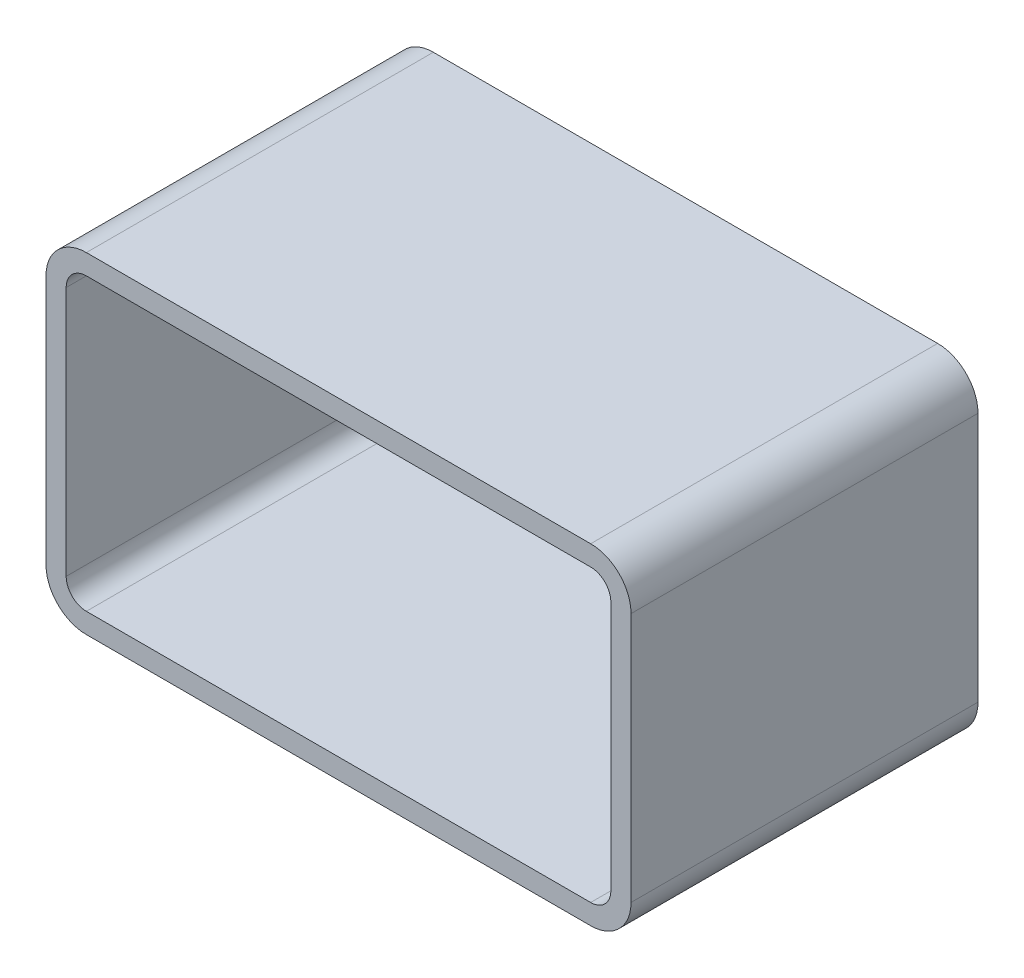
ISO-10303-21;
HEADER;
FILE_DESCRIPTION(('STEP AP214'),'2;1');
FILE_NAME('part.step','',(''),(''),'','','');
FILE_SCHEMA(('AUTOMOTIVE_DESIGN { 1 0 10303 214 1 1 1 1 }'));
ENDSEC;
DATA;
#1=APPLICATION_CONTEXT('core data for automotive mechanical design processes');
#2=APPLICATION_PROTOCOL_DEFINITION('international standard','automotive_design',2000,#1);
#3=PRODUCT_CONTEXT('',#1,'mechanical');
#4=PRODUCT('Part','Part','',(#3));
#5=PRODUCT_RELATED_PRODUCT_CATEGORY('part','',(#4));
#6=PRODUCT_DEFINITION_FORMATION('','',#4);
#7=PRODUCT_DEFINITION_CONTEXT('part definition',#1,'design');
#8=PRODUCT_DEFINITION('design','',#6,#7);
#9=PRODUCT_DEFINITION_SHAPE('','',#8);
#10=(LENGTH_UNIT() NAMED_UNIT(*) SI_UNIT(.MILLI.,.METRE.));
#11=(NAMED_UNIT(*) PLANE_ANGLE_UNIT() SI_UNIT($,.RADIAN.));
#12=(NAMED_UNIT(*) SI_UNIT($,.STERADIAN.) SOLID_ANGLE_UNIT());
#13=UNCERTAINTY_MEASURE_WITH_UNIT(LENGTH_MEASURE(1.E-05),#10,'distance_accuracy_value','');
#14=(GEOMETRIC_REPRESENTATION_CONTEXT(3) GLOBAL_UNCERTAINTY_ASSIGNED_CONTEXT((#13)) GLOBAL_UNIT_ASSIGNED_CONTEXT((#10,
#11,#12)) REPRESENTATION_CONTEXT('',''));
#15=CARTESIAN_POINT('',(0.,0.,0.));
#16=DIRECTION('',(0.,0.,1.));
#17=DIRECTION('',(1.,0.,0.));
#18=AXIS2_PLACEMENT_3D('',#15,#16,#17);
#19=CARTESIAN_POINT('',(0.,164.,0.));
#20=DIRECTION('',(0.,0.,-1.));
#21=DIRECTION('',(-1.,0.,0.));
#22=AXIS2_PLACEMENT_3D('',#19,#20,#21);
#23=PLANE('',#22);
#24=DIRECTION('',(-1.,0.,0.));
#25=VECTOR('',#24,1.);
#26=CARTESIAN_POINT('',(0.,164.,0.));
#27=LINE('',#26,#25);
#28=CARTESIAN_POINT('',(270.,164.,0.));
#29=VERTEX_POINT('',#28);
#30=CARTESIAN_POINT('',(20.,164.,0.));
#31=VERTEX_POINT('',#30);
#32=EDGE_CURVE('E221',#29,#31,#27,.T.);
#33=ORIENTED_EDGE('',*,*,#32,.T.);
#34=CARTESIAN_POINT('',(20.,144.,0.));
#35=DIRECTION('',(0.,0.,-1.));
#36=DIRECTION('',(-1.,0.,0.));
#37=AXIS2_PLACEMENT_3D('',#34,#35,#36);
#38=CIRCLE('',#37,20.);
#39=CARTESIAN_POINT('',(0.,144.,0.));
#40=VERTEX_POINT('',#39);
#41=EDGE_CURVE('E250',#31,#40,#38,.F.);
#42=ORIENTED_EDGE('',*,*,#41,.T.);
#43=DIRECTION('',(0.,-1.,0.));
#44=VECTOR('',#43,1.);
#45=CARTESIAN_POINT('',(0.,0.,0.));
#46=LINE('',#45,#44);
#47=CARTESIAN_POINT('',(0.,20.,0.));
#48=VERTEX_POINT('',#47);
#49=EDGE_CURVE('E200',#40,#48,#46,.T.);
#50=ORIENTED_EDGE('',*,*,#49,.T.);
#51=CARTESIAN_POINT('',(20.,20.,0.));
#52=DIRECTION('',(0.,0.,-1.));
#53=DIRECTION('',(-1.,0.,0.));
#54=AXIS2_PLACEMENT_3D('',#51,#52,#53);
#55=CIRCLE('',#54,20.);
#56=CARTESIAN_POINT('',(20.,0.,0.));
#57=VERTEX_POINT('',#56);
#58=EDGE_CURVE('E248',#48,#57,#55,.F.);
#59=ORIENTED_EDGE('',*,*,#58,.T.);
#60=DIRECTION('',(1.,0.,0.));
#61=VECTOR('',#60,1.);
#62=CARTESIAN_POINT('',(0.,0.,0.));
#63=LINE('',#62,#61);
#64=CARTESIAN_POINT('',(270.,0.,0.));
#65=VERTEX_POINT('',#64);
#66=EDGE_CURVE('E232',#57,#65,#63,.T.);
#67=ORIENTED_EDGE('',*,*,#66,.T.);
#68=CARTESIAN_POINT('',(270.,20.,0.));
#69=DIRECTION('',(0.,0.,-1.));
#70=DIRECTION('',(-1.,0.,0.));
#71=AXIS2_PLACEMENT_3D('',#68,#69,#70);
#72=CIRCLE('',#71,20.);
#73=CARTESIAN_POINT('',(290.,20.,0.));
#74=VERTEX_POINT('',#73);
#75=EDGE_CURVE('E246',#65,#74,#72,.F.);
#76=ORIENTED_EDGE('',*,*,#75,.T.);
#77=DIRECTION('',(0.,1.,0.));
#78=VECTOR('',#77,1.);
#79=CARTESIAN_POINT('',(290.,0.,0.));
#80=LINE('',#79,#78);
#81=CARTESIAN_POINT('',(290.,144.,0.));
#82=VERTEX_POINT('',#81);
#83=EDGE_CURVE('E235',#74,#82,#80,.T.);
#84=ORIENTED_EDGE('',*,*,#83,.T.);
#85=CARTESIAN_POINT('',(270.,144.,0.));
#86=DIRECTION('',(0.,0.,-1.));
#87=DIRECTION('',(-1.,0.,0.));
#88=AXIS2_PLACEMENT_3D('',#85,#86,#87);
#89=CIRCLE('',#88,20.);
#90=EDGE_CURVE('E244',#82,#29,#89,.F.);
#91=ORIENTED_EDGE('',*,*,#90,.T.);
#92=EDGE_LOOP('',(#33,#42,#50,#59,#67,#76,#84,#91));
#93=FACE_BOUND('',#92,.T.);
#94=DIRECTION('',(-1.,0.,0.));
#95=VECTOR('',#94,1.);
#96=CARTESIAN_POINT('',(0.,154.,0.));
#97=LINE('',#96,#95);
#98=CARTESIAN_POINT('',(270.,154.,0.));
#99=VERTEX_POINT('',#98);
#100=CARTESIAN_POINT('',(20.,154.,0.));
#101=VERTEX_POINT('',#100);
#102=EDGE_CURVE('E168',#99,#101,#97,.T.);
#103=ORIENTED_EDGE('',*,*,#102,.F.);
#104=CARTESIAN_POINT('',(270.,144.,0.));
#105=DIRECTION('',(0.,0.,-1.));
#106=DIRECTION('',(-1.,0.,0.));
#107=AXIS2_PLACEMENT_3D('',#104,#105,#106);
#108=CIRCLE('',#107,10.);
#109=CARTESIAN_POINT('',(280.,144.,0.));
#110=VERTEX_POINT('',#109);
#111=EDGE_CURVE('E195',#110,#99,#108,.F.);
#112=ORIENTED_EDGE('',*,*,#111,.F.);
#113=DIRECTION('',(0.,1.,0.));
#114=VECTOR('',#113,1.);
#115=CARTESIAN_POINT('',(280.,0.,0.));
#116=LINE('',#115,#114);
#117=CARTESIAN_POINT('',(280.,20.,0.));
#118=VERTEX_POINT('',#117);
#119=EDGE_CURVE('E47',#118,#110,#116,.T.);
#120=ORIENTED_EDGE('',*,*,#119,.F.);
#121=CARTESIAN_POINT('',(270.,20.,0.));
#122=DIRECTION('',(0.,0.,-1.));
#123=DIRECTION('',(-1.,0.,0.));
#124=AXIS2_PLACEMENT_3D('',#121,#122,#123);
#125=CIRCLE('',#124,10.);
#126=CARTESIAN_POINT('',(270.,10.,0.));
#127=VERTEX_POINT('',#126);
#128=EDGE_CURVE('E208',#127,#118,#125,.F.);
#129=ORIENTED_EDGE('',*,*,#128,.F.);
#130=DIRECTION('',(1.,0.,0.));
#131=VECTOR('',#130,1.);
#132=CARTESIAN_POINT('',(0.,10.,0.));
#133=LINE('',#132,#131);
#134=CARTESIAN_POINT('',(20.,10.,0.));
#135=VERTEX_POINT('',#134);
#136=EDGE_CURVE('E205',#135,#127,#133,.T.);
#137=ORIENTED_EDGE('',*,*,#136,.F.);
#138=CARTESIAN_POINT('',(20.,20.,0.));
#139=DIRECTION('',(0.,0.,-1.));
#140=DIRECTION('',(-1.,0.,0.));
#141=AXIS2_PLACEMENT_3D('',#138,#139,#140);
#142=CIRCLE('',#141,10.);
#143=CARTESIAN_POINT('',(10.,20.,0.));
#144=VERTEX_POINT('',#143);
#145=EDGE_CURVE('E206',#144,#135,#142,.F.);
#146=ORIENTED_EDGE('',*,*,#145,.F.);
#147=DIRECTION('',(0.,-1.,0.));
#148=VECTOR('',#147,1.);
#149=CARTESIAN_POINT('',(10.,0.,0.));
#150=LINE('',#149,#148);
#151=CARTESIAN_POINT('',(10.,144.,0.));
#152=VERTEX_POINT('',#151);
#153=EDGE_CURVE('E203',#152,#144,#150,.T.);
#154=ORIENTED_EDGE('',*,*,#153,.F.);
#155=CARTESIAN_POINT('',(20.,144.,0.));
#156=DIRECTION('',(0.,0.,-1.));
#157=DIRECTION('',(-1.,0.,0.));
#158=AXIS2_PLACEMENT_3D('',#155,#156,#157);
#159=CIRCLE('',#158,10.);
#160=EDGE_CURVE('E154',#101,#152,#159,.F.);
#161=ORIENTED_EDGE('',*,*,#160,.F.);
#162=EDGE_LOOP('',(#103,#112,#120,#129,#137,#146,#154,#161));
#163=FACE_BOUND('',#162,.T.);
#164=ADVANCED_FACE('F32',(#93,#163),#23,.F.);
#165=CARTESIAN_POINT('',(0.,0.,-172.));
#166=DIRECTION('',(-1.,0.,0.));
#167=DIRECTION('',(0.,0.,1.));
#168=AXIS2_PLACEMENT_3D('',#165,#166,#167);
#169=PLANE('',#168);
#170=ORIENTED_EDGE('',*,*,#49,.F.);
#171=DIRECTION('',(0.,0.,1.));
#172=VECTOR('',#171,1.);
#173=CARTESIAN_POINT('',(0.,144.,-172.));
#174=LINE('',#173,#172);
#175=CARTESIAN_POINT('',(0.,144.,-172.));
#176=VERTEX_POINT('',#175);
#177=EDGE_CURVE('E255',#40,#176,#174,.F.);
#178=ORIENTED_EDGE('',*,*,#177,.T.);
#179=DIRECTION('',(0.,-1.,0.));
#180=VECTOR('',#179,1.);
#181=CARTESIAN_POINT('',(0.,0.,-172.));
#182=LINE('',#181,#180);
#183=CARTESIAN_POINT('',(0.,20.,-172.));
#184=VERTEX_POINT('',#183);
#185=EDGE_CURVE('E217',#176,#184,#182,.T.);
#186=ORIENTED_EDGE('',*,*,#185,.T.);
#187=DIRECTION('',(0.,0.,1.));
#188=VECTOR('',#187,1.);
#189=CARTESIAN_POINT('',(0.,20.,-172.));
#190=LINE('',#189,#188);
#191=EDGE_CURVE('E252',#184,#48,#190,.T.);
#192=ORIENTED_EDGE('',*,*,#191,.T.);
#193=EDGE_LOOP('',(#170,#178,#186,#192));
#194=FACE_BOUND('',#193,.T.);
#195=ADVANCED_FACE('F294',(#194),#169,.T.);
#196=CARTESIAN_POINT('',(0.,164.,-172.));
#197=DIRECTION('',(0.,1.,0.));
#198=DIRECTION('',(0.,0.,1.));
#199=AXIS2_PLACEMENT_3D('',#196,#197,#198);
#200=PLANE('',#199);
#201=DIRECTION('',(-1.,0.,0.));
#202=VECTOR('',#201,1.);
#203=CARTESIAN_POINT('',(0.,164.,-172.));
#204=LINE('',#203,#202);
#205=CARTESIAN_POINT('',(270.,164.,-172.));
#206=VERTEX_POINT('',#205);
#207=CARTESIAN_POINT('',(20.,164.,-172.));
#208=VERTEX_POINT('',#207);
#209=EDGE_CURVE('E226',#206,#208,#204,.T.);
#210=ORIENTED_EDGE('',*,*,#209,.T.);
#211=DIRECTION('',(0.,0.,1.));
#212=VECTOR('',#211,1.);
#213=CARTESIAN_POINT('',(20.,164.,-172.));
#214=LINE('',#213,#212);
#215=EDGE_CURVE('E241',#208,#31,#214,.T.);
#216=ORIENTED_EDGE('',*,*,#215,.T.);
#217=ORIENTED_EDGE('',*,*,#32,.F.);
#218=DIRECTION('',(0.,0.,1.));
#219=VECTOR('',#218,1.);
#220=CARTESIAN_POINT('',(270.,164.,-172.));
#221=LINE('',#220,#219);
#222=EDGE_CURVE('E229',#29,#206,#221,.F.);
#223=ORIENTED_EDGE('',*,*,#222,.T.);
#224=EDGE_LOOP('',(#210,#216,#217,#223));
#225=FACE_BOUND('',#224,.T.);
#226=ADVANCED_FACE('F301',(#225),#200,.T.);
#227=CARTESIAN_POINT('',(290.,0.,-172.));
#228=DIRECTION('',(1.,0.,0.));
#229=DIRECTION('',(0.,0.,-1.));
#230=AXIS2_PLACEMENT_3D('',#227,#228,#229);
#231=PLANE('',#230);
#232=ORIENTED_EDGE('',*,*,#83,.F.);
#233=DIRECTION('',(0.,0.,1.));
#234=VECTOR('',#233,1.);
#235=CARTESIAN_POINT('',(290.,20.,-172.));
#236=LINE('',#235,#234);
#237=CARTESIAN_POINT('',(290.,20.,-172.));
#238=VERTEX_POINT('',#237);
#239=EDGE_CURVE('E11',#74,#238,#236,.F.);
#240=ORIENTED_EDGE('',*,*,#239,.T.);
#241=DIRECTION('',(0.,1.,0.));
#242=VECTOR('',#241,1.);
#243=CARTESIAN_POINT('',(290.,0.,-172.));
#244=LINE('',#243,#242);
#245=CARTESIAN_POINT('',(290.,144.,-172.));
#246=VERTEX_POINT('',#245);
#247=EDGE_CURVE('E223',#238,#246,#244,.T.);
#248=ORIENTED_EDGE('',*,*,#247,.T.);
#249=DIRECTION('',(0.,0.,1.));
#250=VECTOR('',#249,1.);
#251=CARTESIAN_POINT('',(290.,144.,-172.));
#252=LINE('',#251,#250);
#253=EDGE_CURVE('E40',#246,#82,#252,.T.);
#254=ORIENTED_EDGE('',*,*,#253,.T.);
#255=EDGE_LOOP('',(#232,#240,#248,#254));
#256=FACE_BOUND('',#255,.T.);
#257=ADVANCED_FACE('F272',(#256),#231,.T.);
#258=CARTESIAN_POINT('',(0.,0.,-172.));
#259=DIRECTION('',(0.,-1.,0.));
#260=DIRECTION('',(0.,0.,-1.));
#261=AXIS2_PLACEMENT_3D('',#258,#259,#260);
#262=PLANE('',#261);
#263=ORIENTED_EDGE('',*,*,#66,.F.);
#264=DIRECTION('',(0.,0.,1.));
#265=VECTOR('',#264,1.);
#266=CARTESIAN_POINT('',(20.,0.,-172.));
#267=LINE('',#266,#265);
#268=CARTESIAN_POINT('',(20.,0.,-172.));
#269=VERTEX_POINT('',#268);
#270=EDGE_CURVE('E267',#57,#269,#267,.F.);
#271=ORIENTED_EDGE('',*,*,#270,.T.);
#272=DIRECTION('',(1.,0.,0.));
#273=VECTOR('',#272,1.);
#274=CARTESIAN_POINT('',(0.,0.,-172.));
#275=LINE('',#274,#273);
#276=CARTESIAN_POINT('',(270.,0.,-172.));
#277=VERTEX_POINT('',#276);
#278=EDGE_CURVE('E220',#269,#277,#275,.T.);
#279=ORIENTED_EDGE('',*,*,#278,.T.);
#280=DIRECTION('',(0.,0.,1.));
#281=VECTOR('',#280,1.);
#282=CARTESIAN_POINT('',(270.,0.,-172.));
#283=LINE('',#282,#281);
#284=EDGE_CURVE('E264',#277,#65,#283,.T.);
#285=ORIENTED_EDGE('',*,*,#284,.T.);
#286=EDGE_LOOP('',(#263,#271,#279,#285));
#287=FACE_BOUND('',#286,.T.);
#288=ADVANCED_FACE('F284',(#287),#262,.T.);
#289=CARTESIAN_POINT('',(0.,164.,-172.));
#290=DIRECTION('',(0.,0.,-1.));
#291=DIRECTION('',(-1.,0.,0.));
#292=AXIS2_PLACEMENT_3D('',#289,#290,#291);
#293=PLANE('',#292);
#294=ORIENTED_EDGE('',*,*,#185,.F.);
#295=CARTESIAN_POINT('',(20.,144.,-172.));
#296=DIRECTION('',(0.,0.,-1.));
#297=DIRECTION('',(-1.,0.,0.));
#298=AXIS2_PLACEMENT_3D('',#295,#296,#297);
#299=CIRCLE('',#298,20.);
#300=EDGE_CURVE('E262',#176,#208,#299,.T.);
#301=ORIENTED_EDGE('',*,*,#300,.T.);
#302=ORIENTED_EDGE('',*,*,#209,.F.);
#303=CARTESIAN_POINT('',(270.,144.,-172.));
#304=DIRECTION('',(0.,0.,-1.));
#305=DIRECTION('',(-1.,0.,0.));
#306=AXIS2_PLACEMENT_3D('',#303,#304,#305);
#307=CIRCLE('',#306,20.);
#308=EDGE_CURVE('E257',#206,#246,#307,.T.);
#309=ORIENTED_EDGE('',*,*,#308,.T.);
#310=ORIENTED_EDGE('',*,*,#247,.F.);
#311=CARTESIAN_POINT('',(270.,20.,-172.));
#312=DIRECTION('',(0.,0.,-1.));
#313=DIRECTION('',(-1.,0.,0.));
#314=AXIS2_PLACEMENT_3D('',#311,#312,#313);
#315=CIRCLE('',#314,20.);
#316=EDGE_CURVE('E55',#238,#277,#315,.T.);
#317=ORIENTED_EDGE('',*,*,#316,.T.);
#318=ORIENTED_EDGE('',*,*,#278,.F.);
#319=CARTESIAN_POINT('',(20.,20.,-172.));
#320=DIRECTION('',(0.,0.,-1.));
#321=DIRECTION('',(-1.,0.,0.));
#322=AXIS2_PLACEMENT_3D('',#319,#320,#321);
#323=CIRCLE('',#322,20.);
#324=EDGE_CURVE('E260',#269,#184,#323,.T.);
#325=ORIENTED_EDGE('',*,*,#324,.T.);
#326=EDGE_LOOP('',(#294,#301,#302,#309,#310,#317,#318,#325));
#327=FACE_BOUND('',#326,.T.);
#328=ADVANCED_FACE('F288',(#327),#293,.T.);
#329=CARTESIAN_POINT('',(20.,144.,-172.));
#330=DIRECTION('',(0.,0.,1.));
#331=DIRECTION('',(1.,0.,0.));
#332=AXIS2_PLACEMENT_3D('',#329,#330,#331);
#333=CYLINDRICAL_SURFACE('',#332,20.);
#334=ORIENTED_EDGE('',*,*,#300,.F.);
#335=ORIENTED_EDGE('',*,*,#177,.F.);
#336=ORIENTED_EDGE('',*,*,#41,.F.);
#337=ORIENTED_EDGE('',*,*,#215,.F.);
#338=EDGE_LOOP('',(#334,#335,#336,#337));
#339=FACE_BOUND('',#338,.T.);
#340=ADVANCED_FACE('F299',(#339),#333,.T.);
#341=CARTESIAN_POINT('',(20.,20.,-172.));
#342=DIRECTION('',(0.,0.,1.));
#343=DIRECTION('',(1.,0.,0.));
#344=AXIS2_PLACEMENT_3D('',#341,#342,#343);
#345=CYLINDRICAL_SURFACE('',#344,20.);
#346=ORIENTED_EDGE('',*,*,#324,.F.);
#347=ORIENTED_EDGE('',*,*,#270,.F.);
#348=ORIENTED_EDGE('',*,*,#58,.F.);
#349=ORIENTED_EDGE('',*,*,#191,.F.);
#350=EDGE_LOOP('',(#346,#347,#348,#349));
#351=FACE_BOUND('',#350,.T.);
#352=ADVANCED_FACE('F291',(#351),#345,.T.);
#353=CARTESIAN_POINT('',(270.,20.,-172.));
#354=DIRECTION('',(0.,0.,1.));
#355=DIRECTION('',(1.,0.,0.));
#356=AXIS2_PLACEMENT_3D('',#353,#354,#355);
#357=CYLINDRICAL_SURFACE('',#356,20.);
#358=ORIENTED_EDGE('',*,*,#316,.F.);
#359=ORIENTED_EDGE('',*,*,#239,.F.);
#360=ORIENTED_EDGE('',*,*,#75,.F.);
#361=ORIENTED_EDGE('',*,*,#284,.F.);
#362=EDGE_LOOP('',(#358,#359,#360,#361));
#363=FACE_BOUND('',#362,.T.);
#364=ADVANCED_FACE('F282',(#363),#357,.T.);
#365=CARTESIAN_POINT('',(270.,144.,-172.));
#366=DIRECTION('',(0.,0.,1.));
#367=DIRECTION('',(1.,0.,0.));
#368=AXIS2_PLACEMENT_3D('',#365,#366,#367);
#369=CYLINDRICAL_SURFACE('',#368,20.);
#370=ORIENTED_EDGE('',*,*,#308,.F.);
#371=ORIENTED_EDGE('',*,*,#222,.F.);
#372=ORIENTED_EDGE('',*,*,#90,.F.);
#373=ORIENTED_EDGE('',*,*,#253,.F.);
#374=EDGE_LOOP('',(#370,#371,#372,#373));
#375=FACE_BOUND('',#374,.T.);
#376=ADVANCED_FACE('F34',(#375),#369,.T.);
#377=CARTESIAN_POINT('',(10.,0.,-172.));
#378=DIRECTION('',(-1.,0.,0.));
#379=DIRECTION('',(0.,0.,1.));
#380=AXIS2_PLACEMENT_3D('',#377,#378,#379);
#381=PLANE('',#380);
#382=ORIENTED_EDGE('',*,*,#153,.T.);
#383=DIRECTION('',(0.,0.,1.));
#384=VECTOR('',#383,1.);
#385=CARTESIAN_POINT('',(10.,20.,-172.));
#386=LINE('',#385,#384);
#387=CARTESIAN_POINT('',(10.,20.,-162.));
#388=VERTEX_POINT('',#387);
#389=EDGE_CURVE('E159',#388,#144,#386,.T.);
#390=ORIENTED_EDGE('',*,*,#389,.F.);
#391=DIRECTION('',(0.,-1.,0.));
#392=VECTOR('',#391,1.);
#393=CARTESIAN_POINT('',(10.,0.,-162.));
#394=LINE('',#393,#392);
#395=CARTESIAN_POINT('',(10.,144.,-162.));
#396=VERTEX_POINT('',#395);
#397=EDGE_CURVE('E163',#396,#388,#394,.T.);
#398=ORIENTED_EDGE('',*,*,#397,.F.);
#399=DIRECTION('',(0.,0.,1.));
#400=VECTOR('',#399,1.);
#401=CARTESIAN_POINT('',(10.,144.,-172.));
#402=LINE('',#401,#400);
#403=EDGE_CURVE('E147',#152,#396,#402,.F.);
#404=ORIENTED_EDGE('',*,*,#403,.F.);
#405=EDGE_LOOP('',(#382,#390,#398,#404));
#406=FACE_BOUND('',#405,.T.);
#407=ADVANCED_FACE('F164',(#406),#381,.F.);
#408=CARTESIAN_POINT('',(0.,154.,-172.));
#409=DIRECTION('',(0.,1.,0.));
#410=DIRECTION('',(0.,0.,1.));
#411=AXIS2_PLACEMENT_3D('',#408,#409,#410);
#412=PLANE('',#411);
#413=DIRECTION('',(-1.,0.,0.));
#414=VECTOR('',#413,1.);
#415=CARTESIAN_POINT('',(0.,154.,-162.));
#416=LINE('',#415,#414);
#417=CARTESIAN_POINT('',(270.,154.,-162.));
#418=VERTEX_POINT('',#417);
#419=CARTESIAN_POINT('',(20.,154.,-162.));
#420=VERTEX_POINT('',#419);
#421=EDGE_CURVE('E173',#418,#420,#416,.T.);
#422=ORIENTED_EDGE('',*,*,#421,.F.);
#423=DIRECTION('',(0.,0.,1.));
#424=VECTOR('',#423,1.);
#425=CARTESIAN_POINT('',(270.,154.,-172.));
#426=LINE('',#425,#424);
#427=EDGE_CURVE('E185',#99,#418,#426,.F.);
#428=ORIENTED_EDGE('',*,*,#427,.F.);
#429=ORIENTED_EDGE('',*,*,#102,.T.);
#430=DIRECTION('',(0.,0.,1.));
#431=VECTOR('',#430,1.);
#432=CARTESIAN_POINT('',(20.,154.,-172.));
#433=LINE('',#432,#431);
#434=EDGE_CURVE('E193',#420,#101,#433,.T.);
#435=ORIENTED_EDGE('',*,*,#434,.F.);
#436=EDGE_LOOP('',(#422,#428,#429,#435));
#437=FACE_BOUND('',#436,.T.);
#438=ADVANCED_FACE('F309',(#437),#412,.F.);
#439=CARTESIAN_POINT('',(280.,0.,-172.));
#440=DIRECTION('',(1.,0.,0.));
#441=DIRECTION('',(0.,0.,-1.));
#442=AXIS2_PLACEMENT_3D('',#439,#440,#441);
#443=PLANE('',#442);
#444=ORIENTED_EDGE('',*,*,#119,.T.);
#445=DIRECTION('',(0.,0.,-1.));
#446=VECTOR('',#445,1.);
#447=CARTESIAN_POINT('',(280.,144.,-172.));
#448=LINE('',#447,#446);
#449=CARTESIAN_POINT('',(280.,144.,-162.));
#450=VERTEX_POINT('',#449);
#451=EDGE_CURVE('E197',#450,#110,#448,.F.);
#452=ORIENTED_EDGE('',*,*,#451,.F.);
#453=DIRECTION('',(0.,1.,0.));
#454=VECTOR('',#453,1.);
#455=CARTESIAN_POINT('',(280.,0.,-162.));
#456=LINE('',#455,#454);
#457=CARTESIAN_POINT('',(280.,20.,-162.));
#458=VERTEX_POINT('',#457);
#459=EDGE_CURVE('E186',#458,#450,#456,.T.);
#460=ORIENTED_EDGE('',*,*,#459,.F.);
#461=DIRECTION('',(0.,0.,-1.));
#462=VECTOR('',#461,1.);
#463=CARTESIAN_POINT('',(280.,20.,-172.));
#464=LINE('',#463,#462);
#465=EDGE_CURVE('E199',#118,#458,#464,.T.);
#466=ORIENTED_EDGE('',*,*,#465,.F.);
#467=EDGE_LOOP('',(#444,#452,#460,#466));
#468=FACE_BOUND('',#467,.T.);
#469=ADVANCED_FACE('F361',(#468),#443,.F.);
#470=CARTESIAN_POINT('',(0.,10.,-172.));
#471=DIRECTION('',(0.,-1.,0.));
#472=DIRECTION('',(0.,0.,-1.));
#473=AXIS2_PLACEMENT_3D('',#470,#471,#472);
#474=PLANE('',#473);
#475=ORIENTED_EDGE('',*,*,#136,.T.);
#476=DIRECTION('',(0.,0.,-1.));
#477=VECTOR('',#476,1.);
#478=CARTESIAN_POINT('',(270.,10.,-172.));
#479=LINE('',#478,#477);
#480=CARTESIAN_POINT('',(270.,10.,-162.));
#481=VERTEX_POINT('',#480);
#482=EDGE_CURVE('E175',#481,#127,#479,.F.);
#483=ORIENTED_EDGE('',*,*,#482,.F.);
#484=DIRECTION('',(1.,0.,0.));
#485=VECTOR('',#484,1.);
#486=CARTESIAN_POINT('',(0.,10.,-162.));
#487=LINE('',#486,#485);
#488=CARTESIAN_POINT('',(20.,10.,-162.));
#489=VERTEX_POINT('',#488);
#490=EDGE_CURVE('E167',#489,#481,#487,.T.);
#491=ORIENTED_EDGE('',*,*,#490,.F.);
#492=DIRECTION('',(0.,0.,-1.));
#493=VECTOR('',#492,1.);
#494=CARTESIAN_POINT('',(20.,10.,-172.));
#495=LINE('',#494,#493);
#496=EDGE_CURVE('E178',#135,#489,#495,.T.);
#497=ORIENTED_EDGE('',*,*,#496,.F.);
#498=EDGE_LOOP('',(#475,#483,#491,#497));
#499=FACE_BOUND('',#498,.T.);
#500=ADVANCED_FACE('F371',(#499),#474,.F.);
#501=CARTESIAN_POINT('',(0.,164.,-162.));
#502=DIRECTION('',(0.,0.,-1.));
#503=DIRECTION('',(-1.,0.,0.));
#504=AXIS2_PLACEMENT_3D('',#501,#502,#503);
#505=PLANE('',#504);
#506=ORIENTED_EDGE('',*,*,#397,.T.);
#507=CARTESIAN_POINT('',(20.,20.,-162.));
#508=DIRECTION('',(0.,0.,-1.));
#509=DIRECTION('',(-1.,0.,0.));
#510=AXIS2_PLACEMENT_3D('',#507,#508,#509);
#511=CIRCLE('',#510,10.);
#512=EDGE_CURVE('E176',#489,#388,#511,.T.);
#513=ORIENTED_EDGE('',*,*,#512,.F.);
#514=ORIENTED_EDGE('',*,*,#490,.T.);
#515=CARTESIAN_POINT('',(270.,20.,-162.));
#516=DIRECTION('',(0.,0.,-1.));
#517=DIRECTION('',(-1.,0.,0.));
#518=AXIS2_PLACEMENT_3D('',#515,#516,#517);
#519=CIRCLE('',#518,10.);
#520=EDGE_CURVE('E180',#458,#481,#519,.T.);
#521=ORIENTED_EDGE('',*,*,#520,.F.);
#522=ORIENTED_EDGE('',*,*,#459,.T.);
#523=CARTESIAN_POINT('',(270.,144.,-162.));
#524=DIRECTION('',(0.,0.,-1.));
#525=DIRECTION('',(-1.,0.,0.));
#526=AXIS2_PLACEMENT_3D('',#523,#524,#525);
#527=CIRCLE('',#526,10.);
#528=EDGE_CURVE('E158',#418,#450,#527,.T.);
#529=ORIENTED_EDGE('',*,*,#528,.F.);
#530=ORIENTED_EDGE('',*,*,#421,.T.);
#531=CARTESIAN_POINT('',(20.,144.,-162.));
#532=DIRECTION('',(0.,0.,-1.));
#533=DIRECTION('',(-1.,0.,0.));
#534=AXIS2_PLACEMENT_3D('',#531,#532,#533);
#535=CIRCLE('',#534,10.);
#536=EDGE_CURVE('E151',#396,#420,#535,.T.);
#537=ORIENTED_EDGE('',*,*,#536,.F.);
#538=EDGE_LOOP('',(#506,#513,#514,#521,#522,#529,#530,#537));
#539=FACE_BOUND('',#538,.T.);
#540=ADVANCED_FACE('F170',(#539),#505,.F.);
#541=CARTESIAN_POINT('',(20.,144.,-172.));
#542=DIRECTION('',(0.,0.,1.));
#543=DIRECTION('',(1.,0.,0.));
#544=AXIS2_PLACEMENT_3D('',#541,#542,#543);
#545=CYLINDRICAL_SURFACE('',#544,10.);
#546=ORIENTED_EDGE('',*,*,#536,.T.);
#547=ORIENTED_EDGE('',*,*,#434,.T.);
#548=ORIENTED_EDGE('',*,*,#160,.T.);
#549=ORIENTED_EDGE('',*,*,#403,.T.);
#550=EDGE_LOOP('',(#546,#547,#548,#549));
#551=FACE_BOUND('',#550,.T.);
#552=ADVANCED_FACE('F149',(#551),#545,.F.);
#553=CARTESIAN_POINT('',(20.,20.,-172.));
#554=DIRECTION('',(0.,0.,1.));
#555=DIRECTION('',(1.,0.,0.));
#556=AXIS2_PLACEMENT_3D('',#553,#554,#555);
#557=CYLINDRICAL_SURFACE('',#556,10.);
#558=ORIENTED_EDGE('',*,*,#512,.T.);
#559=ORIENTED_EDGE('',*,*,#389,.T.);
#560=ORIENTED_EDGE('',*,*,#145,.T.);
#561=ORIENTED_EDGE('',*,*,#496,.T.);
#562=EDGE_LOOP('',(#558,#559,#560,#561));
#563=FACE_BOUND('',#562,.T.);
#564=ADVANCED_FACE('F397',(#563),#557,.F.);
#565=CARTESIAN_POINT('',(270.,20.,-172.));
#566=DIRECTION('',(0.,0.,1.));
#567=DIRECTION('',(1.,0.,0.));
#568=AXIS2_PLACEMENT_3D('',#565,#566,#567);
#569=CYLINDRICAL_SURFACE('',#568,10.);
#570=ORIENTED_EDGE('',*,*,#520,.T.);
#571=ORIENTED_EDGE('',*,*,#482,.T.);
#572=ORIENTED_EDGE('',*,*,#128,.T.);
#573=ORIENTED_EDGE('',*,*,#465,.T.);
#574=EDGE_LOOP('',(#570,#571,#572,#573));
#575=FACE_BOUND('',#574,.T.);
#576=ADVANCED_FACE('F406',(#575),#569,.F.);
#577=CARTESIAN_POINT('',(270.,144.,-172.));
#578=DIRECTION('',(0.,0.,1.));
#579=DIRECTION('',(1.,0.,0.));
#580=AXIS2_PLACEMENT_3D('',#577,#578,#579);
#581=CYLINDRICAL_SURFACE('',#580,10.);
#582=ORIENTED_EDGE('',*,*,#528,.T.);
#583=ORIENTED_EDGE('',*,*,#451,.T.);
#584=ORIENTED_EDGE('',*,*,#111,.T.);
#585=ORIENTED_EDGE('',*,*,#427,.T.);
#586=EDGE_LOOP('',(#582,#583,#584,#585));
#587=FACE_BOUND('',#586,.T.);
#588=ADVANCED_FACE('F416',(#587),#581,.F.);
#589=CLOSED_SHELL('',(#164,#195,#226,#257,#288,#328,#340,#352,#364,#376,#407,#438,#469,#500,
#540,#552,#564,#576,#588));
#590=MANIFOLD_SOLID_BREP('B2',#589);
#591=ADVANCED_BREP_SHAPE_REPRESENTATION('',(#18,#590),#14);
#592=SHAPE_DEFINITION_REPRESENTATION(#9,#591);
ENDSEC;
END-ISO-10303-21;
